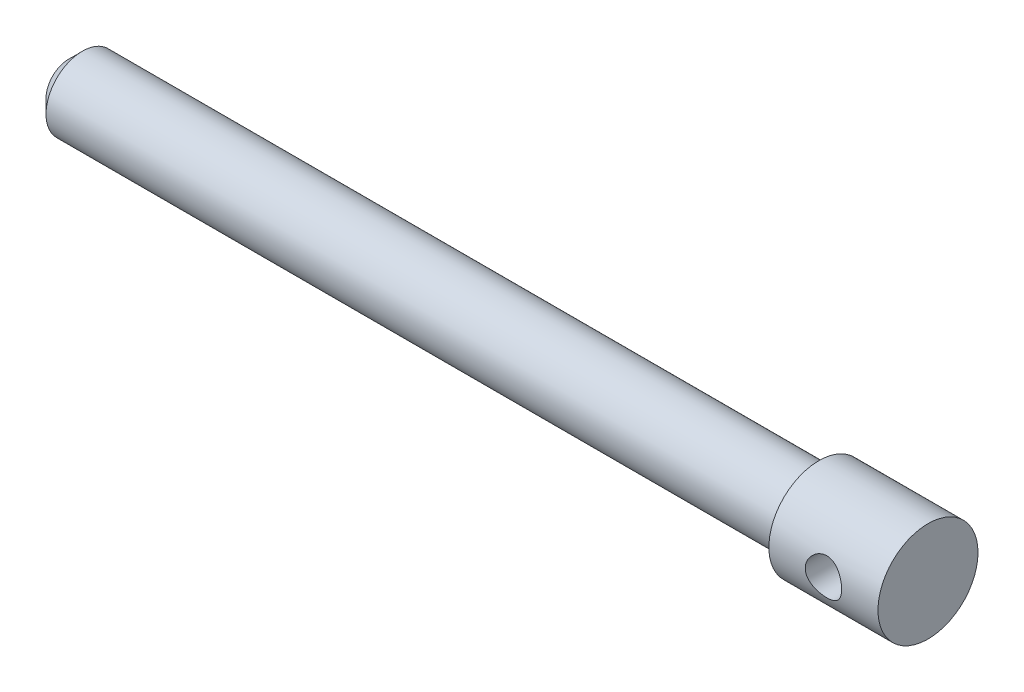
ISO-10303-21;
HEADER;
FILE_DESCRIPTION(('STEP AP214'),'2;1');
FILE_NAME('part.step','',(''),(''),'','','');
FILE_SCHEMA(('AUTOMOTIVE_DESIGN { 1 0 10303 214 1 1 1 1 }'));
ENDSEC;
DATA;
#1=APPLICATION_CONTEXT('core data for automotive mechanical design processes');
#2=APPLICATION_PROTOCOL_DEFINITION('international standard','automotive_design',2000,#1);
#3=PRODUCT_CONTEXT('',#1,'mechanical');
#4=PRODUCT('Part','Part','',(#3));
#5=PRODUCT_RELATED_PRODUCT_CATEGORY('part','',(#4));
#6=PRODUCT_DEFINITION_FORMATION('','',#4);
#7=PRODUCT_DEFINITION_CONTEXT('part definition',#1,'design');
#8=PRODUCT_DEFINITION('design','',#6,#7);
#9=PRODUCT_DEFINITION_SHAPE('','',#8);
#10=(LENGTH_UNIT() NAMED_UNIT(*) SI_UNIT(.MILLI.,.METRE.));
#11=(NAMED_UNIT(*) PLANE_ANGLE_UNIT() SI_UNIT($,.RADIAN.));
#12=(NAMED_UNIT(*) SI_UNIT($,.STERADIAN.) SOLID_ANGLE_UNIT());
#13=UNCERTAINTY_MEASURE_WITH_UNIT(LENGTH_MEASURE(1.E-05),#10,'distance_accuracy_value','');
#14=(GEOMETRIC_REPRESENTATION_CONTEXT(3) GLOBAL_UNCERTAINTY_ASSIGNED_CONTEXT((#13)) GLOBAL_UNIT_ASSIGNED_CONTEXT((#10,
#11,#12)) REPRESENTATION_CONTEXT('',''));
#15=CARTESIAN_POINT('',(0.,0.,0.));
#16=DIRECTION('',(0.,0.,1.));
#17=DIRECTION('',(1.,0.,0.));
#18=AXIS2_PLACEMENT_3D('',#15,#16,#17);
#19=CARTESIAN_POINT('',(82.5,0.,0.));
#20=DIRECTION('',(-1.,0.,0.));
#21=DIRECTION('',(0.,0.,1.));
#22=AXIS2_PLACEMENT_3D('',#19,#20,#21);
#23=CYLINDRICAL_SURFACE('',#22,8.);
#24=CARTESIAN_POINT('',(-79.5,0.,0.));
#25=DIRECTION('',(1.,0.,0.));
#26=DIRECTION('',(0.,0.,-1.));
#27=AXIS2_PLACEMENT_3D('',#24,#25,#26);
#28=CIRCLE('',#27,8.);
#29=CARTESIAN_POINT('',(-79.5,0.,-8.));
#30=VERTEX_POINT('',#29);
#31=EDGE_CURVE('E74',#30,#30,#28,.T.);
#32=ORIENTED_EDGE('',*,*,#31,.T.);
#33=EDGE_LOOP('',(#32));
#34=FACE_BOUND('',#33,.T.);
#35=CARTESIAN_POINT('',(82.5,0.,0.));
#36=DIRECTION('',(1.,0.,0.));
#37=DIRECTION('',(0.,0.,-1.));
#38=AXIS2_PLACEMENT_3D('',#35,#36,#37);
#39=CIRCLE('',#38,8.);
#40=CARTESIAN_POINT('',(82.5,0.,-8.));
#41=VERTEX_POINT('',#40);
#42=EDGE_CURVE('E114',#41,#41,#39,.T.);
#43=ORIENTED_EDGE('',*,*,#42,.F.);
#44=EDGE_LOOP('',(#43));
#45=FACE_BOUND('',#44,.T.);
#46=ADVANCED_FACE('F51',(#34,#45),#23,.T.);
#47=CARTESIAN_POINT('',(-82.5,0.,0.));
#48=DIRECTION('',(1.,0.,0.));
#49=DIRECTION('',(0.,0.,-1.));
#50=AXIS2_PLACEMENT_3D('',#47,#48,#49);
#51=PLANE('',#50);
#52=CARTESIAN_POINT('',(-82.5,0.,0.));
#53=DIRECTION('',(1.,0.,0.));
#54=DIRECTION('',(0.,0.,-1.));
#55=AXIS2_PLACEMENT_3D('',#52,#53,#54);
#56=CIRCLE('',#55,4.99999999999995);
#57=CARTESIAN_POINT('',(-82.5,0.,-4.99999999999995));
#58=VERTEX_POINT('',#57);
#59=EDGE_CURVE('E69',#58,#58,#56,.F.);
#60=ORIENTED_EDGE('',*,*,#59,.T.);
#61=EDGE_LOOP('',(#60));
#62=FACE_BOUND('',#61,.T.);
#63=ADVANCED_FACE('F104',(#62),#51,.F.);
#64=CARTESIAN_POINT('',(106.5,0.,0.));
#65=DIRECTION('',(-1.,0.,0.));
#66=DIRECTION('',(0.,0.,1.));
#67=AXIS2_PLACEMENT_3D('',#64,#65,#66);
#68=CYLINDRICAL_SURFACE('',#67,11.);
#69=CARTESIAN_POINT('',(98.5,0.,-11.));
#70=CARTESIAN_POINT('',(98.5000002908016,0.108518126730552,-11.0000002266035));
#71=CARTESIAN_POINT('',(98.4955802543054,0.217031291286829,-10.9983905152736));
#72=CARTESIAN_POINT('',(98.4779442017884,0.433282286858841,-10.9919958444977));
#73=CARTESIAN_POINT('',(98.4647252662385,0.541019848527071,-10.9872098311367));
#74=CARTESIAN_POINT('',(98.429622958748,0.754845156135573,-10.974591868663));
#75=CARTESIAN_POINT('',(98.4077436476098,0.860933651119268,-10.9667613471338));
#76=CARTESIAN_POINT('',(98.3555362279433,1.07077170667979,-10.948268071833));
#77=CARTESIAN_POINT('',(98.3252048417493,1.17452034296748,-10.9376042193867));
#78=CARTESIAN_POINT('',(98.2220586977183,1.48070658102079,-10.9018115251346));
#79=CARTESIAN_POINT('',(98.136985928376,1.6787218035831,-10.87284149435));
#80=CARTESIAN_POINT('',(97.9369305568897,2.0575471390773,-10.8075711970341));
#81=CARTESIAN_POINT('',(97.8219404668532,2.2383529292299,-10.7712690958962));
#82=CARTESIAN_POINT('',(97.5604341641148,2.5850641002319,-10.6934621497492));
#83=CARTESIAN_POINT('',(97.4129244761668,2.75018962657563,-10.6518162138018));
#84=CARTESIAN_POINT('',(97.0926839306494,3.05397061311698,-10.5687333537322));
#85=CARTESIAN_POINT('',(96.9199460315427,3.19261865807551,-10.5272964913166));
#86=CARTESIAN_POINT('',(96.5466900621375,3.44434007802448,-10.4477077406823));
#87=CARTESIAN_POINT('',(96.3454054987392,3.556335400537,-10.4097238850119));
#88=CARTESIAN_POINT('',(95.9252570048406,3.74453898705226,-10.3435224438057));
#89=CARTESIAN_POINT('',(95.7063996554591,3.8207605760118,-10.3153012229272));
#90=CARTESIAN_POINT('',(95.2662826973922,3.93221347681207,-10.2733217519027));
#91=CARTESIAN_POINT('',(95.0454501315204,3.96892832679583,-10.2590420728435));
#92=CARTESIAN_POINT('',(94.6003324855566,4.0049643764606,-10.2450315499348));
#93=CARTESIAN_POINT('',(94.3760487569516,4.00429985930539,-10.2452951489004));
#94=CARTESIAN_POINT('',(93.943695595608,3.96673535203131,-10.2598897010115));
#95=CARTESIAN_POINT('',(93.7354191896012,3.93185708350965,-10.2734357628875));
#96=CARTESIAN_POINT('',(93.3279070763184,3.8301848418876,-10.3117702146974));
#97=CARTESIAN_POINT('',(93.1286726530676,3.76338635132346,-10.3365601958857));
#98=CARTESIAN_POINT('',(92.7406472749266,3.59860097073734,-10.3950857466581));
#99=CARTESIAN_POINT('',(92.5521121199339,3.50006900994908,-10.4289757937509));
#100=CARTESIAN_POINT('',(92.1936504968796,3.27499293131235,-10.5018277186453));
#101=CARTESIAN_POINT('',(92.0237302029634,3.14843956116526,-10.5407912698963));
#102=CARTESIAN_POINT('',(91.6960805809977,2.86153351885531,-10.6223913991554));
#103=CARTESIAN_POINT('',(91.539790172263,2.69955565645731,-10.6651048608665));
#104=CARTESIAN_POINT('',(91.256177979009,2.35118575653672,-10.7472749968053));
#105=CARTESIAN_POINT('',(91.128860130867,2.16479040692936,-10.7867312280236));
#106=CARTESIAN_POINT('',(90.9053456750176,1.76938296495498,-10.8586443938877));
#107=CARTESIAN_POINT('',(90.8096015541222,1.56009488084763,-10.8909975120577));
#108=CARTESIAN_POINT('',(90.6551497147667,1.12691583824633,-10.9442944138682));
#109=CARTESIAN_POINT('',(90.5964265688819,0.903031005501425,-10.9652429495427));
#110=CARTESIAN_POINT('',(90.520387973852,0.459144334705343,-10.9925485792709));
#111=CARTESIAN_POINT('',(90.5011330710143,0.239516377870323,-10.9995884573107));
#112=CARTESIAN_POINT('',(90.4989649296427,-0.199918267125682,-11.000375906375));
#113=CARTESIAN_POINT('',(90.5160441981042,-0.419724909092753,-10.9941262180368));
#114=CARTESIAN_POINT('',(90.584566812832,-0.845072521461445,-10.9694878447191));
#115=CARTESIAN_POINT('',(90.6347624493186,-1.05084266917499,-10.9515401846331));
#116=CARTESIAN_POINT('',(90.7664737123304,-1.45091434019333,-10.9057517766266));
#117=CARTESIAN_POINT('',(90.8479934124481,-1.64521436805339,-10.8779097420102));
#118=CARTESIAN_POINT('',(91.0425911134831,-2.02306155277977,-10.8141114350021));
#119=CARTESIAN_POINT('',(91.1565066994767,-2.20614086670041,-10.7779454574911));
#120=CARTESIAN_POINT('',(91.4117061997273,-2.55118135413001,-10.7015304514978));
#121=CARTESIAN_POINT('',(91.5529997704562,-2.71313504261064,-10.6612799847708));
#122=CARTESIAN_POINT('',(91.8680155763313,-3.02054310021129,-10.5784236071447));
#123=CARTESIAN_POINT('',(92.0430851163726,-3.16461797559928,-10.5358088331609));
#124=CARTESIAN_POINT('',(92.4157819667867,-3.42158820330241,-10.4551865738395));
#125=CARTESIAN_POINT('',(92.6134106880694,-3.53448160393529,-10.4171793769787));
#126=CARTESIAN_POINT('',(93.0267458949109,-3.72578370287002,-10.3503083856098));
#127=CARTESIAN_POINT('',(93.2424895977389,-3.80411923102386,-10.3214640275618));
#128=CARTESIAN_POINT('',(93.6854348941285,-3.92287909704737,-10.2769217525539));
#129=CARTESIAN_POINT('',(93.9126298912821,-3.9633250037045,-10.2612163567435));
#130=CARTESIAN_POINT('',(94.3571826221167,-4.00329400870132,-10.245684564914));
#131=CARTESIAN_POINT('',(94.5743007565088,-4.00515133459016,-10.2449524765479));
#132=CARTESIAN_POINT('',(95.0055791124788,-3.97380469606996,-10.2571513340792));
#133=CARTESIAN_POINT('',(95.2197395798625,-3.94060366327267,-10.2700811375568));
#134=CARTESIAN_POINT('',(95.633189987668,-3.84185635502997,-10.3074143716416));
#135=CARTESIAN_POINT('',(95.8327251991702,-3.77720646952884,-10.3314989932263));
#136=CARTESIAN_POINT('',(96.2182452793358,-3.61816905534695,-10.3882601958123));
#137=CARTESIAN_POINT('',(96.4042268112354,-3.52377423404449,-10.4209388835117));
#138=CARTESIAN_POINT('',(96.7674840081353,-3.30242059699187,-10.4932450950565));
#139=CARTESIAN_POINT('',(96.9438569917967,-3.17406750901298,-10.5331386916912));
#140=CARTESIAN_POINT('',(97.2732961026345,-2.89069247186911,-10.6144069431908));
#141=CARTESIAN_POINT('',(97.4263550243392,-2.73566230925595,-10.6557820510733));
#142=CARTESIAN_POINT('',(97.7126154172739,-2.39397199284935,-10.7378363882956));
#143=CARTESIAN_POINT('',(97.8444539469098,-2.20612371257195,-10.7783791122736));
#144=CARTESIAN_POINT('',(98.0169903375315,-1.90891818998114,-10.8335715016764));
#145=CARTESIAN_POINT('',(98.0703224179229,-1.80721425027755,-10.8510404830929));
#146=CARTESIAN_POINT('',(98.1681619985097,-1.59930059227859,-10.8836243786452));
#147=CARTESIAN_POINT('',(98.2126733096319,-1.49309284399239,-10.8987403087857));
#148=CARTESIAN_POINT('',(98.2932084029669,-1.27489280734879,-10.9264345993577));
#149=CARTESIAN_POINT('',(98.329057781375,-1.16282946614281,-10.9389601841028));
#150=CARTESIAN_POINT('',(98.3907912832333,-0.935724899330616,-10.9607217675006));
#151=CARTESIAN_POINT('',(98.4166796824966,-0.820684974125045,-10.9699591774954));
#152=CARTESIAN_POINT('',(98.4582194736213,-0.588557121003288,-10.9848588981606));
#153=CARTESIAN_POINT('',(98.4738722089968,-0.471469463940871,-10.9905216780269));
#154=CARTESIAN_POINT('',(98.4947619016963,-0.236252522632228,-10.9980919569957));
#155=CARTESIAN_POINT('',(98.499999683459,-0.11812332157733,-10.9999997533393));
#156=CARTESIAN_POINT('',(98.5,0.,-11.));
#157=B_SPLINE_CURVE_WITH_KNOTS('',3,(#69,#70,#71,#72,#73,#74,#75,#76,#77,#78,#79,#80,#81,#82,
#83,#84,#85,#86,#87,#88,#89,#90,#91,#92,#93,#94,#95,#96,#97,#98,#99,#100,#101,#102,#103,#104,
#105,#106,#107,#108,#109,#110,#111,#112,#113,#114,#115,#116,#117,#118,#119,#120,#121,#122,#123,
#124,#125,#126,#127,#128,#129,#130,#131,#132,#133,#134,#135,#136,#137,#138,#139,#140,#141,#142,
#143,#144,#145,#146,#147,#148,#149,#150,#151,#152,#153,#154,#155,#156),.UNSPECIFIED.,.T.,.F.,(4,
2,2,2,2,2,2,2,2,2,2,2,2,2,2,2,2,2,2,2,2,2,2,2,2,2,2,2,2,2,2,2,2,2,2,2,2,2,2,2,2,2,2,4),(0.,
0.325443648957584,0.650995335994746,0.976394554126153,1.30192013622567,1.95105392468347,
2.60035033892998,3.27323297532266,3.94630378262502,4.64318153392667,5.33979950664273,
6.00923247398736,6.67840964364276,7.31028887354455,7.94225755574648,8.58571857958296,
9.22939238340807,9.91355007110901,10.5978006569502,11.2914695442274,11.9848491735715,
12.6432497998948,13.3015146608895,13.9362952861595,14.5711584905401,15.224218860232,
15.8775099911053,16.5663909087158,17.2553149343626,17.9456907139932,18.6356732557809,
19.283788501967,19.9318495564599,20.5624345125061,21.1931741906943,21.8555070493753,
22.5180441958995,23.213470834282,23.5615867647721,23.9095519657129,24.2640282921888,
24.6183522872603,24.9726297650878,25.3268791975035),.UNSPECIFIED.);
#158=CARTESIAN_POINT('',(98.5,0.,-11.));
#159=VERTEX_POINT('',#158);
#160=EDGE_CURVE('E10',#159,#159,#157,.T.);
#161=ORIENTED_EDGE('',*,*,#160,.T.);
#162=EDGE_LOOP('',(#161));
#163=FACE_BOUND('',#162,.T.);
#164=CARTESIAN_POINT('',(98.5,0.,11.));
#165=CARTESIAN_POINT('',(98.5000002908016,-0.108518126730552,11.0000002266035));
#166=CARTESIAN_POINT('',(98.4955802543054,-0.217031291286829,10.9983905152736));
#167=CARTESIAN_POINT('',(98.4779442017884,-0.433282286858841,10.9919958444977));
#168=CARTESIAN_POINT('',(98.4647252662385,-0.541019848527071,10.9872098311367));
#169=CARTESIAN_POINT('',(98.429622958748,-0.754845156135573,10.974591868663));
#170=CARTESIAN_POINT('',(98.4077436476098,-0.860933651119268,10.9667613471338));
#171=CARTESIAN_POINT('',(98.3555362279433,-1.07077170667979,10.948268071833));
#172=CARTESIAN_POINT('',(98.3252048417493,-1.17452034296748,10.9376042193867));
#173=CARTESIAN_POINT('',(98.2220586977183,-1.48070658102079,10.9018115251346));
#174=CARTESIAN_POINT('',(98.136985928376,-1.6787218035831,10.87284149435));
#175=CARTESIAN_POINT('',(97.9369305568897,-2.0575471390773,10.8075711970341));
#176=CARTESIAN_POINT('',(97.8219404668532,-2.2383529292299,10.7712690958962));
#177=CARTESIAN_POINT('',(97.5604341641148,-2.5850641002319,10.6934621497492));
#178=CARTESIAN_POINT('',(97.4129244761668,-2.75018962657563,10.6518162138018));
#179=CARTESIAN_POINT('',(97.0926839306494,-3.05397061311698,10.5687333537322));
#180=CARTESIAN_POINT('',(96.9199460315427,-3.19261865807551,10.5272964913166));
#181=CARTESIAN_POINT('',(96.5466900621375,-3.44434007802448,10.4477077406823));
#182=CARTESIAN_POINT('',(96.3454054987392,-3.556335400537,10.4097238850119));
#183=CARTESIAN_POINT('',(95.9252570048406,-3.74453898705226,10.3435224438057));
#184=CARTESIAN_POINT('',(95.7063996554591,-3.8207605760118,10.3153012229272));
#185=CARTESIAN_POINT('',(95.2662826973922,-3.93221347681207,10.2733217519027));
#186=CARTESIAN_POINT('',(95.0454501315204,-3.96892832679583,10.2590420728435));
#187=CARTESIAN_POINT('',(94.6003324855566,-4.0049643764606,10.2450315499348));
#188=CARTESIAN_POINT('',(94.3760487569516,-4.00429985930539,10.2452951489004));
#189=CARTESIAN_POINT('',(93.943695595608,-3.96673535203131,10.2598897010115));
#190=CARTESIAN_POINT('',(93.7354191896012,-3.93185708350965,10.2734357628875));
#191=CARTESIAN_POINT('',(93.3279070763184,-3.8301848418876,10.3117702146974));
#192=CARTESIAN_POINT('',(93.1286726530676,-3.76338635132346,10.3365601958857));
#193=CARTESIAN_POINT('',(92.7406472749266,-3.59860097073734,10.3950857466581));
#194=CARTESIAN_POINT('',(92.5521121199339,-3.50006900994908,10.4289757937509));
#195=CARTESIAN_POINT('',(92.1936504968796,-3.27499293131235,10.5018277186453));
#196=CARTESIAN_POINT('',(92.0237302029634,-3.14843956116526,10.5407912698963));
#197=CARTESIAN_POINT('',(91.6960805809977,-2.86153351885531,10.6223913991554));
#198=CARTESIAN_POINT('',(91.539790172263,-2.69955565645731,10.6651048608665));
#199=CARTESIAN_POINT('',(91.256177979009,-2.35118575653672,10.7472749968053));
#200=CARTESIAN_POINT('',(91.128860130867,-2.16479040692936,10.7867312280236));
#201=CARTESIAN_POINT('',(90.9053456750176,-1.76938296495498,10.8586443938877));
#202=CARTESIAN_POINT('',(90.8096015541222,-1.56009488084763,10.8909975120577));
#203=CARTESIAN_POINT('',(90.6551497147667,-1.12691583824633,10.9442944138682));
#204=CARTESIAN_POINT('',(90.5964265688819,-0.903031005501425,10.9652429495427));
#205=CARTESIAN_POINT('',(90.520387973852,-0.459144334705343,10.9925485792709));
#206=CARTESIAN_POINT('',(90.5011330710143,-0.239516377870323,10.9995884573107));
#207=CARTESIAN_POINT('',(90.4989649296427,0.199918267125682,11.000375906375));
#208=CARTESIAN_POINT('',(90.5160441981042,0.419724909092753,10.9941262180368));
#209=CARTESIAN_POINT('',(90.584566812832,0.845072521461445,10.9694878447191));
#210=CARTESIAN_POINT('',(90.6347624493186,1.05084266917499,10.9515401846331));
#211=CARTESIAN_POINT('',(90.7664737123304,1.45091434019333,10.9057517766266));
#212=CARTESIAN_POINT('',(90.8479934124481,1.64521436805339,10.8779097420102));
#213=CARTESIAN_POINT('',(91.0425911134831,2.02306155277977,10.8141114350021));
#214=CARTESIAN_POINT('',(91.1565066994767,2.20614086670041,10.7779454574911));
#215=CARTESIAN_POINT('',(91.4117061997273,2.55118135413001,10.7015304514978));
#216=CARTESIAN_POINT('',(91.5529997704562,2.71313504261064,10.6612799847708));
#217=CARTESIAN_POINT('',(91.8680155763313,3.02054310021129,10.5784236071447));
#218=CARTESIAN_POINT('',(92.0430851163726,3.16461797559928,10.5358088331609));
#219=CARTESIAN_POINT('',(92.4157819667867,3.42158820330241,10.4551865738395));
#220=CARTESIAN_POINT('',(92.6134106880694,3.53448160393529,10.4171793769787));
#221=CARTESIAN_POINT('',(93.0267458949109,3.72578370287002,10.3503083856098));
#222=CARTESIAN_POINT('',(93.2424895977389,3.80411923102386,10.3214640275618));
#223=CARTESIAN_POINT('',(93.6854348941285,3.92287909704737,10.2769217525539));
#224=CARTESIAN_POINT('',(93.9126298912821,3.9633250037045,10.2612163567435));
#225=CARTESIAN_POINT('',(94.3571826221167,4.00329400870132,10.245684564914));
#226=CARTESIAN_POINT('',(94.5743007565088,4.00515133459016,10.2449524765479));
#227=CARTESIAN_POINT('',(95.0055791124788,3.97380469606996,10.2571513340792));
#228=CARTESIAN_POINT('',(95.2197395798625,3.94060366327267,10.2700811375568));
#229=CARTESIAN_POINT('',(95.633189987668,3.84185635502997,10.3074143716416));
#230=CARTESIAN_POINT('',(95.8327251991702,3.77720646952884,10.3314989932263));
#231=CARTESIAN_POINT('',(96.2182452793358,3.61816905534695,10.3882601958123));
#232=CARTESIAN_POINT('',(96.4042268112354,3.52377423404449,10.4209388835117));
#233=CARTESIAN_POINT('',(96.7674840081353,3.30242059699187,10.4932450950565));
#234=CARTESIAN_POINT('',(96.9438569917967,3.17406750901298,10.5331386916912));
#235=CARTESIAN_POINT('',(97.2732961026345,2.89069247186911,10.6144069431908));
#236=CARTESIAN_POINT('',(97.4263550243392,2.73566230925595,10.6557820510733));
#237=CARTESIAN_POINT('',(97.7126154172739,2.39397199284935,10.7378363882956));
#238=CARTESIAN_POINT('',(97.8444539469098,2.20612371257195,10.7783791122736));
#239=CARTESIAN_POINT('',(98.0169903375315,1.90891818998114,10.8335715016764));
#240=CARTESIAN_POINT('',(98.0703224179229,1.80721425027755,10.8510404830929));
#241=CARTESIAN_POINT('',(98.1681619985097,1.59930059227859,10.8836243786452));
#242=CARTESIAN_POINT('',(98.2126733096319,1.49309284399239,10.8987403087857));
#243=CARTESIAN_POINT('',(98.2932084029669,1.27489280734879,10.9264345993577));
#244=CARTESIAN_POINT('',(98.329057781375,1.16282946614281,10.9389601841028));
#245=CARTESIAN_POINT('',(98.3907912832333,0.935724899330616,10.9607217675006));
#246=CARTESIAN_POINT('',(98.4166796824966,0.820684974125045,10.9699591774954));
#247=CARTESIAN_POINT('',(98.4582194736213,0.588557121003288,10.9848588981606));
#248=CARTESIAN_POINT('',(98.4738722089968,0.471469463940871,10.9905216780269));
#249=CARTESIAN_POINT('',(98.4947619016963,0.236252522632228,10.9980919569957));
#250=CARTESIAN_POINT('',(98.499999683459,0.11812332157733,10.9999997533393));
#251=CARTESIAN_POINT('',(98.5,0.,11.));
#252=B_SPLINE_CURVE_WITH_KNOTS('',3,(#164,#165,#166,#167,#168,#169,#170,#171,#172,#173,#174,
#175,#176,#177,#178,#179,#180,#181,#182,#183,#184,#185,#186,#187,#188,#189,#190,#191,#192,#193,
#194,#195,#196,#197,#198,#199,#200,#201,#202,#203,#204,#205,#206,#207,#208,#209,#210,#211,#212,
#213,#214,#215,#216,#217,#218,#219,#220,#221,#222,#223,#224,#225,#226,#227,#228,#229,#230,#231,
#232,#233,#234,#235,#236,#237,#238,#239,#240,#241,#242,#243,#244,#245,#246,#247,#248,#249,#250,
#251),.UNSPECIFIED.,.T.,.F.,(4,2,2,2,2,2,2,2,2,2,2,2,2,2,2,2,2,2,2,2,2,2,2,2,2,2,2,2,2,2,2,2,2,
2,2,2,2,2,2,2,2,2,2,4),(0.,0.325443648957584,0.650995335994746,0.976394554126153,
1.30192013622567,1.95105392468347,2.60035033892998,3.27323297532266,3.94630378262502,
4.64318153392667,5.33979950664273,6.00923247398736,6.67840964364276,7.31028887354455,
7.94225755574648,8.58571857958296,9.22939238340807,9.91355007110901,10.5978006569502,
11.2914695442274,11.9848491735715,12.6432497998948,13.3015146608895,13.9362952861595,
14.5711584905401,15.224218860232,15.8775099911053,16.5663909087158,17.2553149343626,
17.9456907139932,18.6356732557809,19.283788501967,19.9318495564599,20.5624345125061,
21.1931741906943,21.8555070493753,22.5180441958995,23.213470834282,23.5615867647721,
23.9095519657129,24.2640282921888,24.6183522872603,24.9726297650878,25.3268791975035),.UNSPECIFIED.);
#253=CARTESIAN_POINT('',(98.5,0.,11.));
#254=VERTEX_POINT('',#253);
#255=EDGE_CURVE('E64',#254,#254,#252,.T.);
#256=ORIENTED_EDGE('',*,*,#255,.T.);
#257=EDGE_LOOP('',(#256));
#258=FACE_BOUND('',#257,.T.);
#259=CARTESIAN_POINT('',(106.5,0.,0.));
#260=DIRECTION('',(1.,0.,0.));
#261=DIRECTION('',(0.,0.,-1.));
#262=AXIS2_PLACEMENT_3D('',#259,#260,#261);
#263=CIRCLE('',#262,11.);
#264=CARTESIAN_POINT('',(106.5,0.,-11.));
#265=VERTEX_POINT('',#264);
#266=EDGE_CURVE('E116',#265,#265,#263,.T.);
#267=ORIENTED_EDGE('',*,*,#266,.F.);
#268=EDGE_LOOP('',(#267));
#269=FACE_BOUND('',#268,.T.);
#270=CARTESIAN_POINT('',(82.5,0.,0.));
#271=DIRECTION('',(1.,0.,0.));
#272=DIRECTION('',(0.,0.,-1.));
#273=AXIS2_PLACEMENT_3D('',#270,#271,#272);
#274=CIRCLE('',#273,11.);
#275=CARTESIAN_POINT('',(82.5,0.,-11.));
#276=VERTEX_POINT('',#275);
#277=EDGE_CURVE('E121',#276,#276,#274,.T.);
#278=ORIENTED_EDGE('',*,*,#277,.T.);
#279=EDGE_LOOP('',(#278));
#280=FACE_BOUND('',#279,.T.);
#281=ADVANCED_FACE('F80',(#163,#258,#269,#280),#68,.T.);
#282=CARTESIAN_POINT('',(106.5,0.,0.));
#283=DIRECTION('',(1.,0.,0.));
#284=DIRECTION('',(0.,0.,-1.));
#285=AXIS2_PLACEMENT_3D('',#282,#283,#284);
#286=PLANE('',#285);
#287=ORIENTED_EDGE('',*,*,#266,.T.);
#288=EDGE_LOOP('',(#287));
#289=FACE_BOUND('',#288,.T.);
#290=ADVANCED_FACE('F89',(#289),#286,.T.);
#291=CARTESIAN_POINT('',(82.5,0.,0.));
#292=DIRECTION('',(1.,0.,0.));
#293=DIRECTION('',(0.,0.,-1.));
#294=AXIS2_PLACEMENT_3D('',#291,#292,#293);
#295=PLANE('',#294);
#296=ORIENTED_EDGE('',*,*,#42,.T.);
#297=EDGE_LOOP('',(#296));
#298=FACE_BOUND('',#297,.T.);
#299=ORIENTED_EDGE('',*,*,#277,.F.);
#300=EDGE_LOOP('',(#299));
#301=FACE_BOUND('',#300,.T.);
#302=ADVANCED_FACE('F92',(#298,#301),#295,.F.);
#303=CARTESIAN_POINT('',(-79.5,0.,0.));
#304=DIRECTION('',(1.,0.,0.));
#305=DIRECTION('',(0.,0.,-1.));
#306=AXIS2_PLACEMENT_3D('',#303,#304,#305);
#307=CONICAL_SURFACE('',#306,8.,0.785398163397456);
#308=ORIENTED_EDGE('',*,*,#59,.F.);
#309=EDGE_LOOP('',(#308));
#310=FACE_BOUND('',#309,.T.);
#311=ORIENTED_EDGE('',*,*,#31,.F.);
#312=EDGE_LOOP('',(#311));
#313=FACE_BOUND('',#312,.T.);
#314=ADVANCED_FACE('F53',(#310,#313),#307,.T.);
#315=CARTESIAN_POINT('',(94.5,0.,-11.));
#316=DIRECTION('',(0.,0.,1.));
#317=DIRECTION('',(1.,0.,0.));
#318=AXIS2_PLACEMENT_3D('',#315,#316,#317);
#319=CYLINDRICAL_SURFACE('',#318,4.00000000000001);
#320=ORIENTED_EDGE('',*,*,#255,.F.);
#321=EDGE_LOOP('',(#320));
#322=FACE_BOUND('',#321,.T.);
#323=ORIENTED_EDGE('',*,*,#160,.F.);
#324=EDGE_LOOP('',(#323));
#325=FACE_BOUND('',#324,.T.);
#326=ADVANCED_FACE('F84',(#322,#325),#319,.F.);
#327=CLOSED_SHELL('',(#46,#63,#281,#290,#302,#314,#326));
#328=MANIFOLD_SOLID_BREP('B2',#327);
#329=ADVANCED_BREP_SHAPE_REPRESENTATION('',(#18,#328),#14);
#330=SHAPE_DEFINITION_REPRESENTATION(#9,#329);
ENDSEC;
END-ISO-10303-21;
